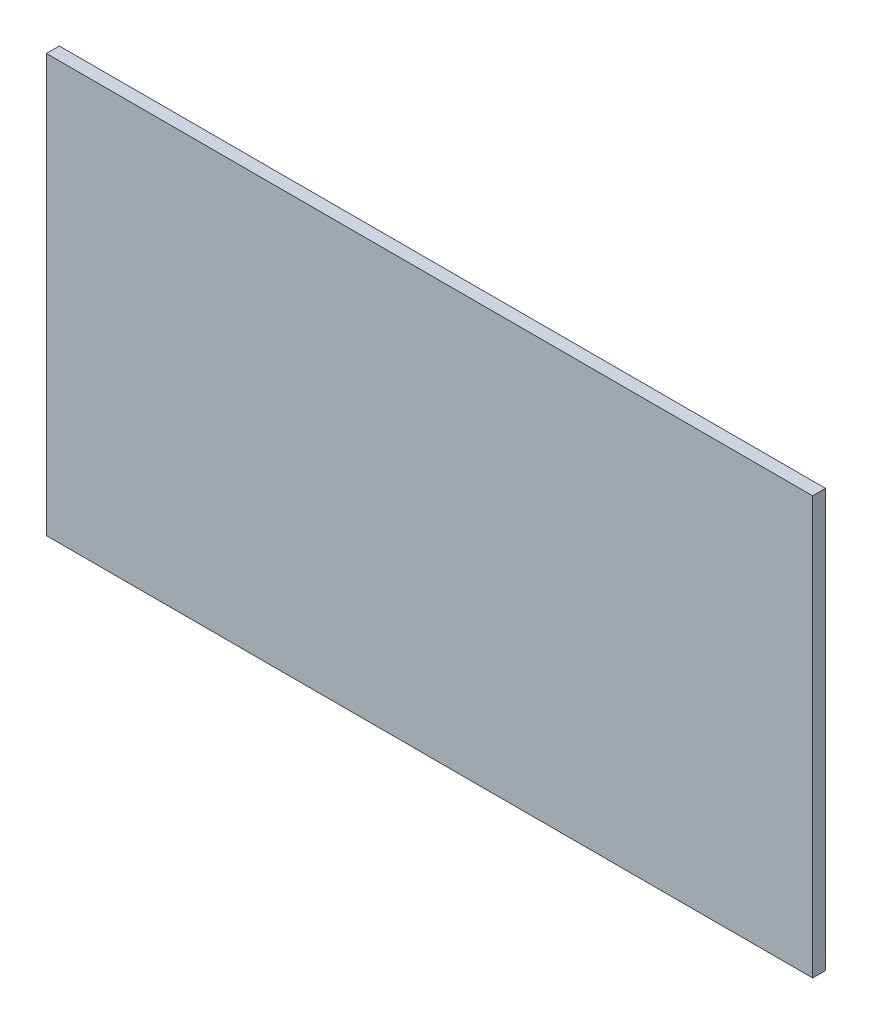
from build123d import *

# Parameters (mm, degrees)
SKETCH1_W           = 356
SKETCH1_H           = 194
BOSS_EXTRUDE1_DEPTH = 6


with BuildPart() as part:
    # Sketch1 → Boss-Extrude1 (new body)
    with BuildSketch(Plane.XY):
        with Locations((178, 97)):
            Rectangle(SKETCH1_W, SKETCH1_H)
    extrude(amount=BOSS_EXTRUDE1_DEPTH)


solid = part.part
